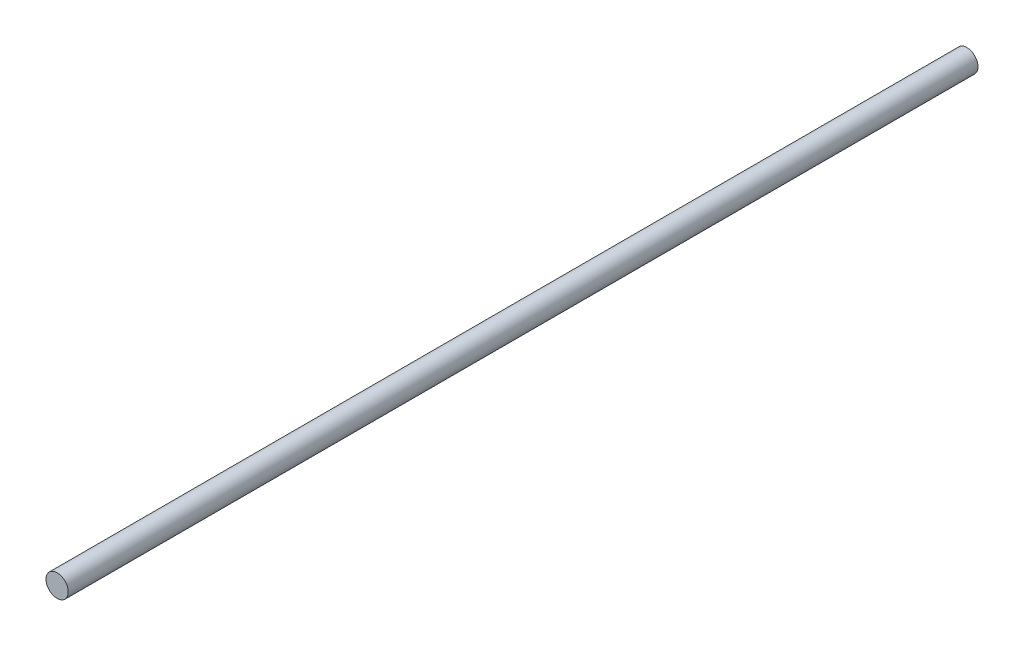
from build123d import *

# Parameters (mm, degrees)
SKETCH1_R           = 30
BOSS_EXTRUDE1_DEPTH = 2450


with BuildPart() as part:
    # Sketch1 → Boss-Extrude1 (new body)
    with BuildSketch(Plane.XY):
        Circle(SKETCH1_R)
    extrude(amount=-BOSS_EXTRUDE1_DEPTH)


solid = part.part
